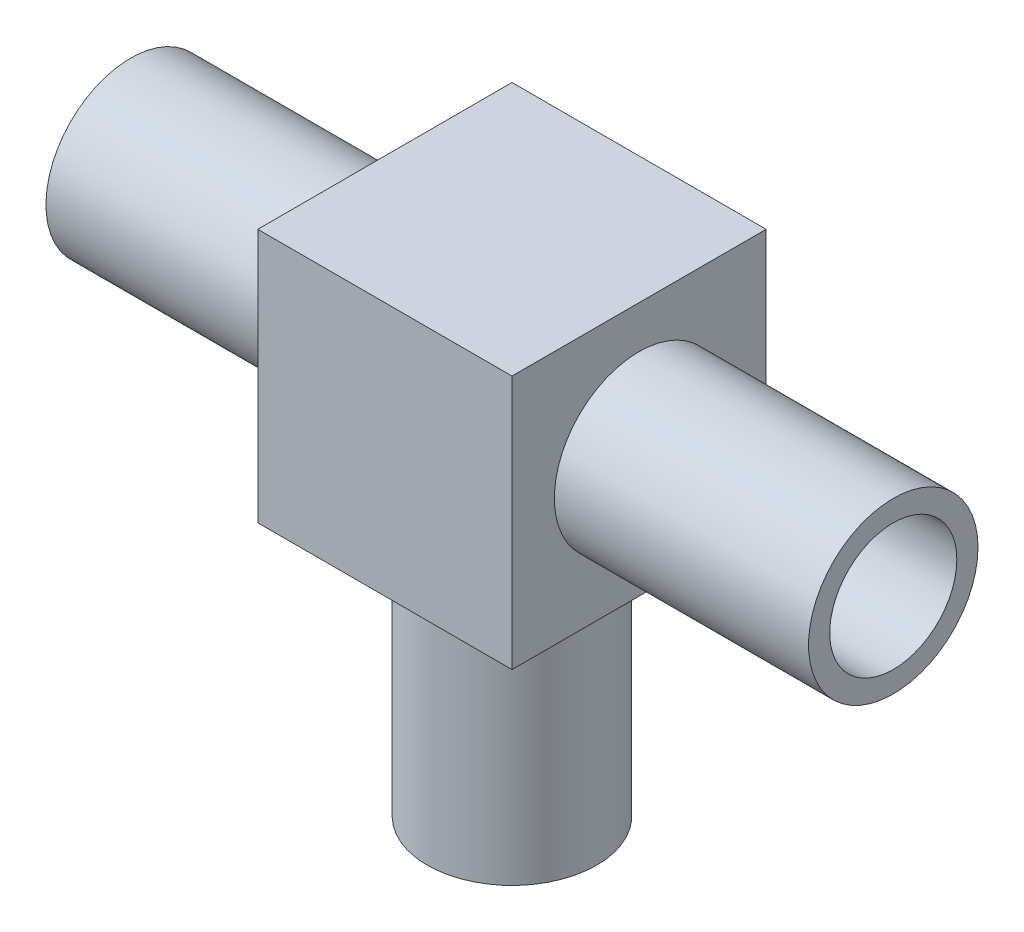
from build123d import *

# Parameters (mm, degrees)
BOSS_EXTRU_1_DEPTH      = 3
BOSS_EXTRU_1_DEPTH_BACK = 3
ESQUISSE1_W             = 6
ESQUISSE1_H             = 6
ESQUISSE2_R             = 2
BOSS_EXTRU_2_DEPTH      = 6
BOSS_EXTRU_3_START      = 6
ESQUISSE3_R             = 2
BOSS_EXTRU_3_DEPTH      = 6
ESQUISSE4_R             = 2
BOSS_EXTRU_4_DEPTH      = 6
ESQUISSE5_R             = 1.5
ENL_V_MAT_EXTRU_1_DEPTH = 21.346989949
ESQUISSE6_R             = 1.5
ENL_V_MAT_EXTRU_2_DEPTH = 9


with BuildPart() as part:
    # Esquisse1 → Boss.-Extru.1 (new, two sides: drawn at the far end of the back side and taken through both)
    with BuildSketch(Plane.XY.offset(-BOSS_EXTRU_1_DEPTH_BACK)):
        Rectangle(ESQUISSE1_W, ESQUISSE1_H)
    extrude(amount=BOSS_EXTRU_1_DEPTH + BOSS_EXTRU_1_DEPTH_BACK)

    # Esquisse2 → Boss.-Extru.2 (add)
    with BuildSketch(Plane.ZY.offset(3)):
        with Locations(Location((0, 0, 0), (0, 0, 270))):
            Circle(ESQUISSE2_R)
    extrude(amount=BOSS_EXTRU_2_DEPTH)

    # Esquisse3 → Boss.-Extru.3 (add)
    with BuildSketch(Plane(origin=(3, 0, 0), x_dir=(0, 0, -1), z_dir=(1, 0, 0)).offset(BOSS_EXTRU_3_START)):
        with Locations(Location((0, 0, 0), (0, 0, 270))):
            Circle(ESQUISSE3_R)
    extrude(amount=-BOSS_EXTRU_3_DEPTH)

    # Esquisse4 → Boss.-Extru.4 (add)
    with BuildSketch(Plane.XZ.offset(3)):
        Circle(ESQUISSE4_R)
    extrude(amount=BOSS_EXTRU_4_DEPTH)

    # Esquisse5 → Enl_v. mat.-Extru.1 (cut, through all)
    with BuildSketch(Plane(origin=(9, 0, 0), x_dir=(0, 0, -1), z_dir=(1, 0, 0))):
        Circle(ESQUISSE5_R)
    extrude(amount=-ENL_V_MAT_EXTRU_1_DEPTH, mode=Mode.SUBTRACT)

    # Esquisse6 → Enl_v. mat.-Extru.2 (cut)
    with BuildSketch(Plane.XZ.offset(9)):
        Circle(ESQUISSE6_R)
    extrude(amount=-ENL_V_MAT_EXTRU_2_DEPTH, mode=Mode.SUBTRACT)


solid = part.part
